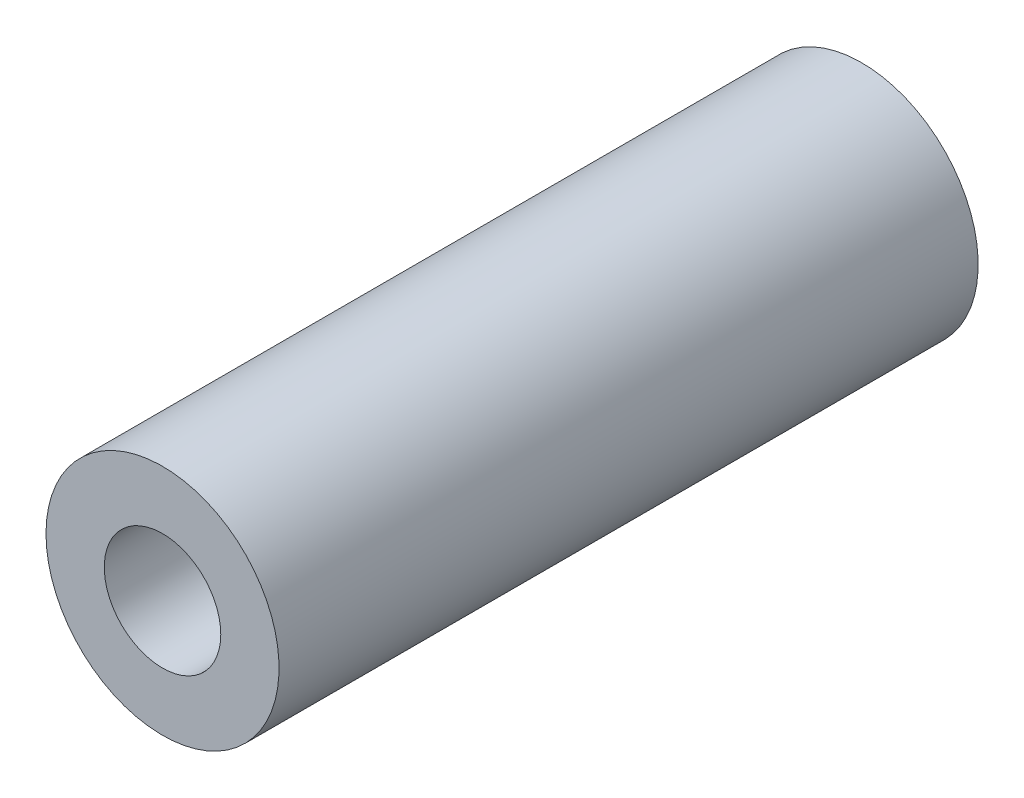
from build123d import *

# Parameters (mm, degrees)
SKETCH1_R           = 3.175
BOSS_EXTRUDE1_DEPTH = 19.05
SKETCH2_R           = 1.5875
CUT_EXTRUDE1_DEPTH  = 38.1


with BuildPart() as part:
    # Sketch1 → Boss-Extrude1 (new body)
    with BuildSketch(Plane.XY):
        with Locations(Location((0, 0, 0), (0, 0, 180))):
            Circle(SKETCH1_R)
    extrude(amount=BOSS_EXTRUDE1_DEPTH)

    # Sketch2 → Cut-Extrude1 (cut)
    with BuildSketch(Plane.XY.offset(19.05)):
        Circle(SKETCH2_R)
    extrude(amount=-CUT_EXTRUDE1_DEPTH, mode=Mode.SUBTRACT)


solid = part.part
